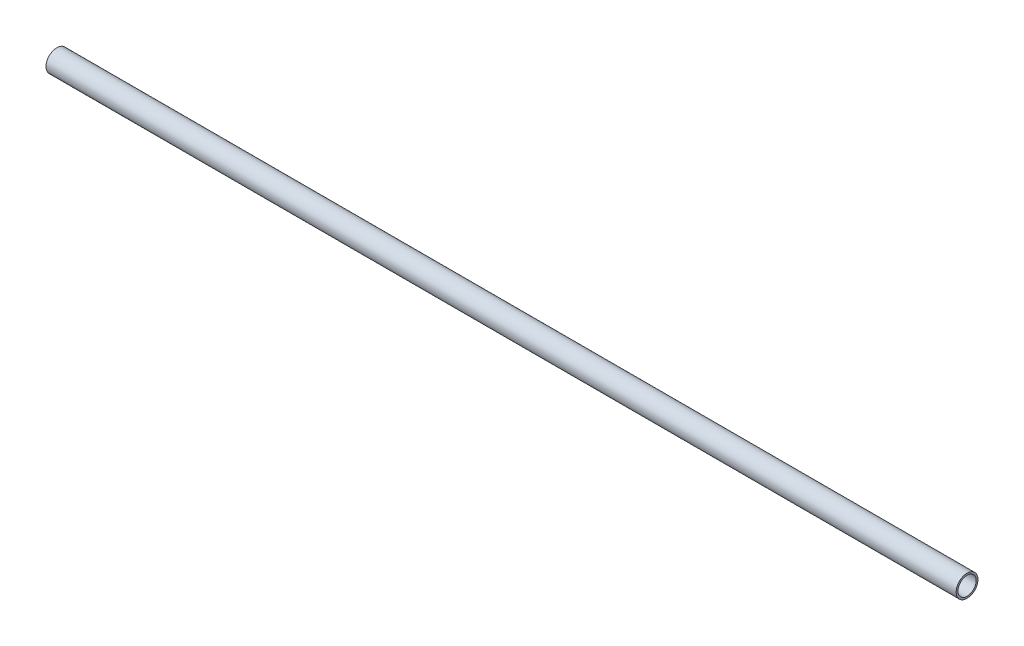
ISO-10303-21;
HEADER;
FILE_DESCRIPTION(('STEP AP214'),'2;1');
FILE_NAME('part.step','',(''),(''),'','','');
FILE_SCHEMA(('AUTOMOTIVE_DESIGN { 1 0 10303 214 1 1 1 1 }'));
ENDSEC;
DATA;
#1=APPLICATION_CONTEXT('core data for automotive mechanical design processes');
#2=APPLICATION_PROTOCOL_DEFINITION('international standard','automotive_design',2000,#1);
#3=PRODUCT_CONTEXT('',#1,'mechanical');
#4=PRODUCT('Part','Part','',(#3));
#5=PRODUCT_RELATED_PRODUCT_CATEGORY('part','',(#4));
#6=PRODUCT_DEFINITION_FORMATION('','',#4);
#7=PRODUCT_DEFINITION_CONTEXT('part definition',#1,'design');
#8=PRODUCT_DEFINITION('design','',#6,#7);
#9=PRODUCT_DEFINITION_SHAPE('','',#8);
#10=(LENGTH_UNIT() NAMED_UNIT(*) SI_UNIT(.MILLI.,.METRE.));
#11=(NAMED_UNIT(*) PLANE_ANGLE_UNIT() SI_UNIT($,.RADIAN.));
#12=(NAMED_UNIT(*) SI_UNIT($,.STERADIAN.) SOLID_ANGLE_UNIT());
#13=UNCERTAINTY_MEASURE_WITH_UNIT(LENGTH_MEASURE(1.E-05),#10,'distance_accuracy_value','');
#14=(GEOMETRIC_REPRESENTATION_CONTEXT(3) GLOBAL_UNCERTAINTY_ASSIGNED_CONTEXT((#13)) GLOBAL_UNIT_ASSIGNED_CONTEXT((#10,
#11,#12)) REPRESENTATION_CONTEXT('',''));
#15=CARTESIAN_POINT('',(0.,0.,0.));
#16=DIRECTION('',(0.,0.,1.));
#17=DIRECTION('',(1.,0.,0.));
#18=AXIS2_PLACEMENT_3D('',#15,#16,#17);
#19=CARTESIAN_POINT('',(10000.,0.,0.));
#20=DIRECTION('',(1.,0.,0.));
#21=DIRECTION('',(0.,0.,-1.));
#22=AXIS2_PLACEMENT_3D('',#19,#20,#21);
#23=PLANE('',#22);
#24=CARTESIAN_POINT('',(10000.,0.,0.));
#25=DIRECTION('',(1.,0.,0.));
#26=DIRECTION('',(0.,0.,-1.));
#27=AXIS2_PLACEMENT_3D('',#24,#25,#26);
#28=CIRCLE('',#27,120.);
#29=CARTESIAN_POINT('',(10000.,0.,-120.));
#30=VERTEX_POINT('',#29);
#31=EDGE_CURVE('E10',#30,#30,#28,.T.);
#32=ORIENTED_EDGE('',*,*,#31,.T.);
#33=EDGE_LOOP('',(#32));
#34=FACE_BOUND('',#33,.T.);
#35=CARTESIAN_POINT('',(10000.,0.,0.));
#36=DIRECTION('',(1.,0.,0.));
#37=DIRECTION('',(0.,0.,-1.));
#38=AXIS2_PLACEMENT_3D('',#35,#36,#37);
#39=CIRCLE('',#38,100.);
#40=CARTESIAN_POINT('',(10000.,0.,-100.));
#41=VERTEX_POINT('',#40);
#42=EDGE_CURVE('E41',#41,#41,#39,.T.);
#43=ORIENTED_EDGE('',*,*,#42,.F.);
#44=EDGE_LOOP('',(#43));
#45=FACE_BOUND('',#44,.T.);
#46=ADVANCED_FACE('F30',(#34,#45),#23,.T.);
#47=CARTESIAN_POINT('',(0.,0.,0.));
#48=DIRECTION('',(1.,0.,0.));
#49=DIRECTION('',(0.,0.,-1.));
#50=AXIS2_PLACEMENT_3D('',#47,#48,#49);
#51=PLANE('',#50);
#52=CARTESIAN_POINT('',(0.,0.,0.));
#53=DIRECTION('',(1.,0.,0.));
#54=DIRECTION('',(0.,0.,-1.));
#55=AXIS2_PLACEMENT_3D('',#52,#53,#54);
#56=CIRCLE('',#55,120.);
#57=CARTESIAN_POINT('',(0.,0.,-120.));
#58=VERTEX_POINT('',#57);
#59=EDGE_CURVE('E34',#58,#58,#56,.T.);
#60=ORIENTED_EDGE('',*,*,#59,.F.);
#61=EDGE_LOOP('',(#60));
#62=FACE_BOUND('',#61,.T.);
#63=CARTESIAN_POINT('',(0.,0.,0.));
#64=DIRECTION('',(1.,0.,0.));
#65=DIRECTION('',(0.,0.,-1.));
#66=AXIS2_PLACEMENT_3D('',#63,#64,#65);
#67=CIRCLE('',#66,100.);
#68=CARTESIAN_POINT('',(0.,0.,-100.));
#69=VERTEX_POINT('',#68);
#70=EDGE_CURVE('E43',#69,#69,#67,.T.);
#71=ORIENTED_EDGE('',*,*,#70,.T.);
#72=EDGE_LOOP('',(#71));
#73=FACE_BOUND('',#72,.T.);
#74=ADVANCED_FACE('F53',(#62,#73),#51,.F.);
#75=CARTESIAN_POINT('',(10000.,0.,0.));
#76=DIRECTION('',(-1.,0.,0.));
#77=DIRECTION('',(0.,0.,1.));
#78=AXIS2_PLACEMENT_3D('',#75,#76,#77);
#79=CYLINDRICAL_SURFACE('',#78,120.);
#80=ORIENTED_EDGE('',*,*,#31,.F.);
#81=EDGE_LOOP('',(#80));
#82=FACE_BOUND('',#81,.T.);
#83=ORIENTED_EDGE('',*,*,#59,.T.);
#84=EDGE_LOOP('',(#83));
#85=FACE_BOUND('',#84,.T.);
#86=ADVANCED_FACE('F32',(#82,#85),#79,.T.);
#87=CARTESIAN_POINT('',(10000.,0.,0.));
#88=DIRECTION('',(-1.,0.,0.));
#89=DIRECTION('',(0.,0.,1.));
#90=AXIS2_PLACEMENT_3D('',#87,#88,#89);
#91=CYLINDRICAL_SURFACE('',#90,100.);
#92=ORIENTED_EDGE('',*,*,#42,.T.);
#93=EDGE_LOOP('',(#92));
#94=FACE_BOUND('',#93,.T.);
#95=ORIENTED_EDGE('',*,*,#70,.F.);
#96=EDGE_LOOP('',(#95));
#97=FACE_BOUND('',#96,.T.);
#98=ADVANCED_FACE('F49',(#94,#97),#91,.F.);
#99=CLOSED_SHELL('',(#46,#74,#86,#98));
#100=MANIFOLD_SOLID_BREP('B2',#99);
#101=ADVANCED_BREP_SHAPE_REPRESENTATION('',(#18,#100),#14);
#102=SHAPE_DEFINITION_REPRESENTATION(#9,#101);
ENDSEC;
END-ISO-10303-21;
